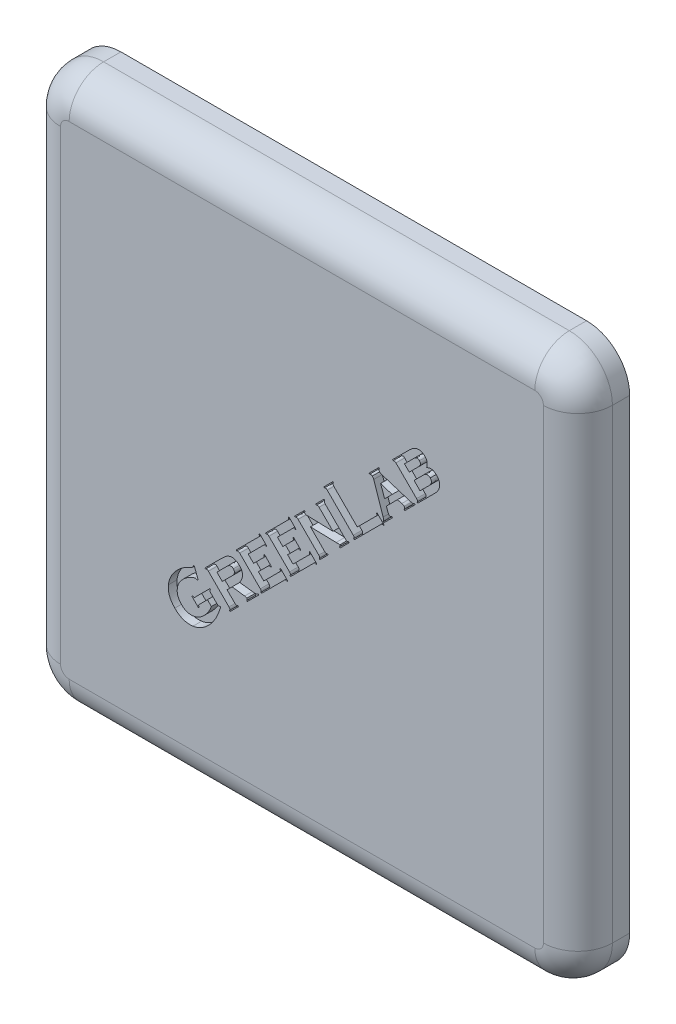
from build123d import *

# Parameters (mm, degrees)
SKETCH1_W           = 32
SKETCH1_H           = 32
BOSS_EXTRUDE1_DEPTH = 3
FILLET1_R           = 2.5
FILLET2_R           = 2
CUT_EXTRUDE1_DEPTH  = 0.5


with BuildPart() as part:
    # Sketch1 → Boss-Extrude1 (new body)
    with BuildSketch(Plane.XY.offset(3)):
        with Locations((6.5, 6.5)):
            Rectangle(SKETCH1_W, SKETCH1_H)
    extrude(amount=-BOSS_EXTRUDE1_DEPTH)

    # Fillet1
    fillet1_edges = [part.edges().sort_by_distance(p)[0] for p in [
        (-9.5, 22.5, 1.5),
        (22.5, 22.5, 1.5),
        (22.5, -9.5, 1.5),
        (-9.5, -9.5, 1.5),
    ]]
    fillet(fillet1_edges, radius=FILLET1_R)

    # Fillet2
    fillet2_edges = [part.edges().sort_by_distance(p)[0] for p in [
        (22.5, 6.5, 3),
        (-9.5, 6.5, 3),
        (6.5, -9.5, 3),
        (6.5, 22.5, 3),
        (-8.767766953, -8.767766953, 3),
        (-8.767766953, 21.767766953, 3),
        (21.767766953, -8.767766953, 3),
        (21.767766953, 21.767766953, 3),
    ]]
    fillet(fillet2_edges, radius=FILLET2_R)

    # Sketch3 → Cut-Extrude1 (cut)
    # profile 1 of 8: a face of its own
    with BuildSketch(Plane.XY.offset(3)):
        with BuildLine():
            add(Edge.make_bspline(
                [(13.726382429, 13.496158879), (13.751079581, 13.504887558), (13.797582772, 13.521323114), (13.864499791, 13.541113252), (13.924768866, 13.552289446), (13.962712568, 13.554714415), (13.980288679, 13.555837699)],
                knots=[0, 0, 0, 0, 1.199889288, 2.259316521, 3.193688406, 4, 4, 4, 4], degree=3))
            add(Edge.make_bspline(
                [(13.980288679, 13.555837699), (13.994804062, 13.554746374), (14.023732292, 13.552571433), (14.066642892, 13.542872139), (14.108899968, 13.528680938), (14.150731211, 13.510253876), (14.191882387, 13.487060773), (14.232345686, 13.459472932), (14.272385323, 13.427101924), (14.297666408, 13.402856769), (14.310692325, 13.390364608)],
                knots=[0, 0, 0, 0, 0.922926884, 1.839334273, 2.783156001, 3.749399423, 4.736154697, 5.777299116, 6.854767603, 8, 8, 8, 8], degree=3))
            add(Edge.make_bspline(
                [(14.310692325, 13.390364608), (14.327190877, 13.372986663), (14.359468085, 13.338989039), (14.400076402, 13.283234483), (14.433652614, 13.226178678), (14.459019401, 13.166976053), (14.475806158, 13.105779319), (14.484983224, 13.042947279), (14.487054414, 12.97819553), (14.481637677, 12.934960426), (14.478878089, 12.912934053)],
                knots=[0, 0, 0, 0, 1.090802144, 2.134008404, 3.134593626, 4.101849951, 5.059406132, 6.017281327, 6.989892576, 8, 8, 8, 8], degree=3))
            add(Edge.make_bspline(
                [(14.478878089, 12.912934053), (14.475102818, 12.892950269), (14.467459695, 12.852492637), (14.448611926, 12.792535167), (14.423525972, 12.73261861), (14.39161634, 12.672731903), (14.353817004, 12.612496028), (14.308644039, 12.552895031), (14.258435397, 12.49230756), (14.220909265, 12.453698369), (14.201642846, 12.433875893)],
                knots=[0, 0, 0, 0, 0.866842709, 1.754943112, 2.674639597, 3.633856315, 4.646099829, 5.704407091, 6.821411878, 8, 8, 8, 8], degree=3))
            Line((14.201642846, 12.433875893), (13.206634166, 11.438867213))
            Line((13.206634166, 11.438867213), (13.171911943, 11.473589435))
            add(Edge.make_bspline(
                [(13.171911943, 11.473589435), (13.175696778, 11.481652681), (13.182787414, 11.49675864), (13.190378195, 11.519425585), (13.193121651, 11.540798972), (13.192068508, 11.561029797), (13.187096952, 11.580947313), (13.176659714, 11.600313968), (13.163271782, 11.620863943), (13.15118493, 11.633117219), (13.144785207, 11.63960506)],
                knots=[0, 0, 0, 0, 1.162374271, 2.177631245, 3.105731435, 3.956794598, 4.809819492, 5.759872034, 6.813901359, 8, 8, 8, 8], degree=3))
            Line((13.144785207, 11.63960506), (11.949038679, 12.835351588))
            add(Edge.make_bspline(
                [(11.949038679, 12.835351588), (11.942458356, 12.841443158), (11.929984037, 12.852990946), (11.910654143, 12.86743399), (11.891312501, 12.876955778), (11.8721236, 12.882137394), (11.852210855, 12.88313564), (11.830702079, 12.880290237), (11.807395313, 12.872774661), (11.791467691, 12.866045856), (11.783023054, 12.862478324)],
                knots=[0, 0, 0, 0, 1.17324, 2.224110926, 3.144897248, 3.977198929, 4.806804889, 5.737271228, 6.800328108, 8, 8, 8, 8], degree=3))
            Line((11.783023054, 12.862478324), (11.748300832, 12.897200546))
            Line((11.748300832, 12.897200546), (12.733543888, 13.882443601))
            add(Edge.make_bspline(
                [(12.733543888, 13.882443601), (12.754671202, 13.902925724), (12.795602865, 13.942607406), (12.858471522, 13.99647432), (12.920461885, 14.04260126), (12.980656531, 14.082155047), (13.039959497, 14.11398944), (13.098367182, 14.137892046), (13.155330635, 14.155537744), (13.193512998, 14.160881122), (13.212059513, 14.163476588)],
                knots=[0, 0, 0, 0, 1.24935704, 2.420480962, 3.512492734, 4.528523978, 5.47670164, 6.365156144, 7.205898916, 8, 8, 8, 8], degree=3))
            add(Edge.make_bspline(
                [(13.212059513, 14.163476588), (13.231035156, 14.164773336), (13.268635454, 14.167342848), (13.324661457, 14.164294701), (13.378960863, 14.153452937), (13.431761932, 14.137482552), (13.48280612, 14.114165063), (13.532079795, 14.084643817), (13.580545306, 14.049364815), (13.609874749, 14.021160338), (13.624928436, 14.006684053)],
                knots=[0, 0, 0, 0, 0.997261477, 1.97607675, 2.932428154, 3.895671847, 4.863762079, 5.867635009, 6.905538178, 8, 8, 8, 8], degree=3))
            add(Edge.make_bspline(
                [(13.624928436, 14.006684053), (13.641315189, 13.989175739), (13.672732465, 13.955608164), (13.7106635, 13.90071592), (13.738591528, 13.844975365), (13.755483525, 13.786504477), (13.761544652, 13.723785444), (13.75894146, 13.654552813), (13.74718017, 13.577524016), (13.73356566, 13.52426119), (13.726382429, 13.496158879)],
                knots=[0, 0, 0, 0, 1.040550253, 1.994980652, 2.887358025, 3.737665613, 4.622542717, 5.612862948, 6.740508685, 8, 8, 8, 8], degree=3))
        make_face()
        with BuildLine():
            Line((12.720523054, 12.758311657), (13.229420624, 13.267209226))
            add(Edge.make_bspline(
                [(13.229420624, 13.267209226), (13.247618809, 13.286284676), (13.281200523, 13.321485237), (13.323488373, 13.374059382), (13.352229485, 13.422460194), (13.369960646, 13.466733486), (13.373671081, 13.509621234), (13.364245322, 13.550836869), (13.343309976, 13.59147593), (13.321771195, 13.614567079), (13.310258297, 13.626909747)],
                knots=[0, 0, 0, 0, 1.494935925, 2.758654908, 3.815734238, 4.678754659, 5.440128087, 6.216547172, 7.046709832, 8, 8, 8, 8], degree=3))
            add(Edge.make_bspline(
                [(13.310258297, 13.626909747), (13.298068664, 13.638200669), (13.275218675, 13.659365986), (13.235313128, 13.680350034), (13.194400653, 13.689843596), (13.15184134, 13.685892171), (13.107135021, 13.669174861), (13.059198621, 13.639220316), (13.005738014, 13.597588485), (12.970645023, 13.563464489), (12.951642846, 13.544987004)],
                knots=[0, 0, 0, 0, 0.940811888, 1.763592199, 2.531601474, 3.294575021, 4.155921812, 5.220444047, 6.494924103, 8, 8, 8, 8], degree=3))
            Line((12.951642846, 13.544987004), (12.442745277, 13.036089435))
            Line((12.442745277, 13.036089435), (12.720523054, 12.758311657))
        make_face(mode=Mode.SUBTRACT)
        with BuildLine():
            Line((13.345523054, 12.133311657), (13.860388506, 12.648177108))
            add(Edge.make_bspline(
                [(13.860388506, 12.648177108), (13.879516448, 12.668179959), (13.915310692, 12.705611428), (13.958347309, 12.764779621), (13.988736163, 12.821363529), (14.005436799, 12.876372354), (14.008676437, 12.929543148), (13.997801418, 12.980492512), (13.973875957, 13.029308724), (13.94888056, 13.056554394), (13.935800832, 13.070811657)],
                knots=[0, 0, 0, 0, 1.361927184, 2.548583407, 3.592382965, 4.511269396, 5.35864216, 6.186693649, 7.051123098, 8, 8, 8, 8], degree=3))
            add(Edge.make_bspline(
                [(13.935800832, 13.070811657), (13.921543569, 13.083891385), (13.894297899, 13.108886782), (13.845481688, 13.132812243), (13.794532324, 13.143687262), (13.741361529, 13.140447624), (13.686352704, 13.123746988), (13.629768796, 13.093358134), (13.570600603, 13.050321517), (13.533169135, 13.014527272), (13.513166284, 12.995399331)],
                knots=[0, 0, 0, 0, 0.948876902, 1.813306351, 2.64135784, 3.488730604, 4.407617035, 5.451416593, 6.638072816, 8, 8, 8, 8], degree=3))
            Line((13.513166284, 12.995399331), (12.998300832, 12.480533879))
            Line((12.998300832, 12.480533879), (13.345523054, 12.133311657))
        make_face(mode=Mode.SUBTRACT)
    # profile 2 of 8: a face of its own
    with BuildSketch(Plane.XY.offset(3)):
        with BuildLine():
            Line((12.039038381, 11.035160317), (11.395592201, 10.391714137))
            Line((11.395592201, 10.391714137), (11.478600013, 10.138350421))
            add(Edge.make_bspline(
                [(11.478600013, 10.138350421), (11.484010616, 10.124702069), (11.494042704, 10.099395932), (11.510845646, 10.065328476), (11.52790598, 10.037954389), (11.540651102, 10.023031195), (11.546416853, 10.016280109)],
                knots=[0, 0, 0, 0, 1.253944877, 2.325006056, 3.242251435, 4, 4, 4, 4], degree=3))
            add(Edge.make_bspline(
                [(11.546416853, 10.016280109), (11.551814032, 10.011116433), (11.562324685, 10.001060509), (11.581170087, 9.991029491), (11.600679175, 9.983881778), (11.621459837, 9.98209722), (11.643176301, 9.983599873), (11.665554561, 9.990076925), (11.689215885, 9.999796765), (11.704418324, 10.009169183), (11.712432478, 10.01410997)],
                knots=[0, 0, 0, 0, 0.98049269, 1.909445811, 2.791921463, 3.703255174, 4.636180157, 5.648641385, 6.76045214, 8, 8, 8, 8], degree=3))
            Line((11.712432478, 10.01410997), (11.747154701, 9.979387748))
            Line((11.747154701, 9.979387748), (11.226321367, 9.458554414))
            Line((11.226321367, 9.458554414), (11.191599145, 9.493276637))
            add(Edge.make_bspline(
                [(11.191599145, 9.493276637), (11.197969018, 9.502546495), (11.209978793, 9.520023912), (11.223643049, 9.546792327), (11.233035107, 9.572032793), (11.236366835, 9.597731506), (11.234754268, 9.625851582), (11.229177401, 9.658961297), (11.218192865, 9.698214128), (11.209402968, 9.726413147), (11.204619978, 9.741757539)],
                knots=[0, 0, 0, 0, 1.025957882, 1.934343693, 2.73859768, 3.471910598, 4.281739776, 5.302501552, 6.532166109, 8, 8, 8, 8], degree=3))
            Line((11.204619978, 9.741757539), (10.657744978, 11.356340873))
            add(Edge.make_bspline(
                [(10.657744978, 11.356340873), (10.652345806, 11.370710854), (10.642137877, 11.397879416), (10.624339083, 11.435510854), (10.603968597, 11.467044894), (10.588152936, 11.484730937), (10.580705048, 11.493059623)],
                knots=[0, 0, 0, 0, 1.164499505, 2.201657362, 3.153127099, 4, 4, 4, 4], degree=3))
            add(Edge.make_bspline(
                [(10.580705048, 11.493059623), (10.571194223, 11.500720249), (10.551987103, 11.516190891), (10.513216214, 11.525391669), (10.469605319, 11.520200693), (10.440356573, 11.509647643), (10.424455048, 11.503910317)],
                knots=[0, 0, 0, 0, 0.872099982, 1.761206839, 2.78284612, 4, 4, 4, 4], degree=3))
            Line((10.424455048, 11.503910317), (10.389732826, 11.538632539))
            Line((10.389732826, 11.538632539), (10.953426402, 12.102326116))
            Line((10.953426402, 12.102326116), (10.988148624, 12.067603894))
            add(Edge.make_bspline(
                [(10.988148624, 12.067603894), (10.982208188, 12.051913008), (10.971243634, 12.022951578), (10.968395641, 11.978537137), (10.979326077, 11.938366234), (10.996343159, 11.917918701), (11.004967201, 11.90755615)],
                knots=[0, 0, 0, 0, 1.168555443, 2.156859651, 3.065919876, 4, 4, 4, 4], degree=3))
            add(Edge.make_bspline(
                [(11.004967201, 11.90755615), (11.013107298, 11.90044725), (11.030560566, 11.885204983), (11.062321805, 11.866108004), (11.100360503, 11.848543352), (11.128370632, 11.83926422), (11.143313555, 11.834313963)],
                knots=[0, 0, 0, 0, 0.820243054, 1.758691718, 2.804300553, 4, 4, 4, 4], degree=3))
            Line((11.143313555, 11.834313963), (12.736738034, 11.330299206))
            add(Edge.make_bspline(
                [(12.736738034, 11.330299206), (12.756765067, 11.324343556), (12.793400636, 11.313448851), (12.843729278, 11.300967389), (12.884006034, 11.292701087), (12.916519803, 11.289748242), (12.945192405, 11.292790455), (12.973275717, 11.301037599), (13.002477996, 11.315290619), (13.021679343, 11.327219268), (13.031876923, 11.333554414)],
                knots=[0, 0, 0, 0, 1.620976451, 2.965261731, 4.022044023, 4.809834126, 5.487011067, 6.246422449, 7.068698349, 8, 8, 8, 8], degree=3))
            Line((13.031876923, 11.333554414), (13.066599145, 11.298832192))
            Line((13.066599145, 11.298832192), (12.458960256, 10.691193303))
            Line((12.458960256, 10.691193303), (12.424238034, 10.725915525))
            add(Edge.make_bspline(
                [(12.424238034, 10.725915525), (12.429574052, 10.733902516), (12.439643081, 10.748973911), (12.449860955, 10.772785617), (12.456835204, 10.795118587), (12.45913898, 10.816870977), (12.457049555, 10.83781895), (12.450178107, 10.857585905), (12.439856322, 10.876785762), (12.429594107, 10.887450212), (12.424238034, 10.89301622)],
                knots=[0, 0, 0, 0, 1.248668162, 2.356228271, 3.36270237, 4.286353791, 5.186571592, 6.080602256, 6.998224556, 8, 8, 8, 8], degree=3))
            add(Edge.make_bspline(
                [(12.424238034, 10.89301622), (12.416110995, 10.900147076), (12.39887318, 10.915271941), (12.366922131, 10.934018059), (12.32912415, 10.952055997), (12.300852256, 10.96134367), (12.28589168, 10.966258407)],
                knots=[0, 0, 0, 0, 0.820374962, 1.740052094, 2.804108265, 4, 4, 4, 4], degree=3))
            Line((12.28589168, 10.966258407), (12.039038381, 11.035160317))
        make_face()
        Polygon((11.724368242, 11.137156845), (11.060305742, 11.359596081), (11.28871286, 10.701501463), align=None, mode=Mode.SUBTRACT)
    # profile 3 of 8: a face of its own
    with BuildSketch(Plane.XY.offset(3)):
        with BuildLine():
            Line((9.707567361, 8.495355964), (10.793721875, 9.581510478))
            add(Edge.make_bspline(
                [(10.793721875, 9.581510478), (10.799826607, 9.588079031), (10.811227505, 9.600346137), (10.8253859, 9.619591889), (10.834605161, 9.638546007), (10.840230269, 9.657488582), (10.840139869, 9.677263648), (10.837839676, 9.698691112), (10.829380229, 9.721528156), (10.822390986, 9.737089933), (10.818678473, 9.745355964)],
                knots=[0, 0, 0, 0, 1.185832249, 2.21460199, 3.145271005, 3.963406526, 4.80089252, 5.741345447, 6.800258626, 8, 8, 8, 8], degree=3))
            Line((10.818678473, 9.745355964), (10.853400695, 9.780078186))
            Line((10.853400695, 9.780078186), (11.270067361, 9.36341152))
            Line((11.270067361, 9.36341152), (11.235345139, 9.328689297))
            add(Edge.make_bspline(
                [(11.235345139, 9.328689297), (11.227078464, 9.332403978), (11.211515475, 9.339397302), (11.18868641, 9.347829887), (11.167233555, 9.35021556), (11.147585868, 9.350029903), (11.128540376, 9.345498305), (11.110231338, 9.335618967), (11.090729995, 9.322591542), (11.078909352, 9.311012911), (11.072584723, 9.30481777)],
                knots=[0, 0, 0, 0, 1.208636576, 2.275400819, 3.222826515, 4.066521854, 4.884713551, 5.800668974, 6.823248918, 8, 8, 8, 8], degree=3))
            Line((11.072584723, 9.30481777), (9.53395625, 7.766189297))
            Line((9.53395625, 7.766189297), (9.499234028, 7.80091152))
            add(Edge.make_bspline(
                [(9.499234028, 7.80091152), (9.503068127, 7.809146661), (9.510335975, 7.824757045), (9.517255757, 7.847951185), (9.52117882, 7.869136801), (9.519924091, 7.888935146), (9.514812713, 7.908113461), (9.505269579, 7.92745832), (9.490833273, 7.946787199), (9.479284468, 7.959261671), (9.473192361, 7.965842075)],
                knots=[0, 0, 0, 0, 1.191880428, 2.259306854, 3.173437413, 4.006453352, 4.842176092, 5.766747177, 6.821937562, 8, 8, 8, 8], degree=3))
            Line((9.473192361, 7.965842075), (7.962775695, 9.476258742))
            add(Edge.make_bspline(
                [(7.962775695, 9.476258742), (7.95619529, 9.482350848), (7.943720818, 9.493899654), (7.92439194, 9.508335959), (7.905047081, 9.517879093), (7.885868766, 9.522990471), (7.866070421, 9.524245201), (7.844884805, 9.520322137), (7.821690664, 9.513402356), (7.80608028, 9.506134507), (7.797845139, 9.502300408)],
                knots=[0, 0, 0, 0, 1.178062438, 2.233252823, 3.157823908, 3.993546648, 4.826562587, 5.740693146, 6.808119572, 8, 8, 8, 8], degree=3))
            Line((7.797845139, 9.502300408), (7.763122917, 9.537022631))
            Line((7.763122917, 9.537022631), (8.28395625, 10.057855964))
            Line((8.28395625, 10.057855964), (8.318678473, 10.023133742))
            add(Edge.make_bspline(
                [(8.318678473, 10.023133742), (8.314628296, 10.015100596), (8.30699226, 9.999955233), (8.299964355, 9.97683704), (8.296263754, 9.95545853), (8.297233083, 9.935200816), (8.303271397, 9.915749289), (8.313157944, 9.896460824), (8.326997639, 9.876365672), (8.3389035, 9.864173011), (8.345262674, 9.857660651)],
                knots=[0, 0, 0, 0, 1.172211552, 2.210039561, 3.141477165, 3.992578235, 4.829152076, 5.779246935, 6.813848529, 8, 8, 8, 8], degree=3))
            Line((8.345262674, 9.857660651), (9.707567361, 8.495355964))
        make_face()
    # profile 4 of 8: a face of its own
    with BuildSketch(Plane.XY.offset(3)):
        with BuildLine():
            Line((6.990343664, 7.145319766), (7.819336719, 6.316326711))
            add(Edge.make_bspline(
                [(7.819336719, 6.316326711), (7.83191851, 6.305036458), (7.854799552, 6.284504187), (7.890175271, 6.269172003), (7.917992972, 6.26797742), (7.93973794, 6.270992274), (7.962974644, 6.277450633), (7.978385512, 6.284455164), (7.986437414, 6.288114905)],
                knots=[0, 0, 0, 0, 1.648152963, 2.997304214, 3.652314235, 4.347366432, 5.136528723, 6, 6, 6, 6], degree=3))
            Line((7.986437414, 6.288114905), (8.021159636, 6.253392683))
            Line((8.021159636, 6.253392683), (7.535048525, 5.767281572))
            Line((7.535048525, 5.767281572), (7.500326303, 5.802003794))
            add(Edge.make_bspline(
                [(7.500326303, 5.802003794), (7.504111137, 5.810067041), (7.511201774, 5.825172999), (7.518792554, 5.847839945), (7.52153601, 5.869213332), (7.520482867, 5.889444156), (7.515511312, 5.909361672), (7.505074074, 5.928728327), (7.491686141, 5.949278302), (7.47959929, 5.961531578), (7.473199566, 5.968019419)],
                knots=[0, 0, 0, 0, 1.162374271, 2.177631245, 3.105731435, 3.956794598, 4.809819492, 5.759872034, 6.813901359, 8, 8, 8, 8], degree=3))
            Line((7.473199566, 5.968019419), (6.277453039, 7.163765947))
            add(Edge.make_bspline(
                [(6.277453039, 7.163765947), (6.270872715, 7.169857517), (6.258398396, 7.181405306), (6.239068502, 7.19584835), (6.21972686, 7.205370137), (6.200537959, 7.210551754), (6.180625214, 7.211549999), (6.159116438, 7.208704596), (6.135809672, 7.20118902), (6.11988205, 7.194460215), (6.111437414, 7.190892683)],
                knots=[0, 0, 0, 0, 1.17324, 2.224110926, 3.144897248, 3.977198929, 4.806804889, 5.737271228, 6.800328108, 8, 8, 8, 8], degree=3))
            Line((6.111437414, 7.190892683), (6.076715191, 7.225614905))
            Line((6.076715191, 7.225614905), (6.643121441, 7.792021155))
            Line((6.643121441, 7.792021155), (6.677843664, 7.757298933))
            add(Edge.make_bspline(
                [(6.677843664, 7.757298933), (6.671870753, 7.746311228), (6.66110079, 7.726498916), (6.653643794, 7.696276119), (6.656024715, 7.668687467), (6.666284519, 7.655353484), (6.671333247, 7.648791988)],
                knots=[0, 0, 0, 0, 1.278287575, 2.304924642, 3.165873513, 4, 4, 4, 4], degree=3))
            add(Edge.make_bspline(
                [(6.671333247, 7.648791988), (6.677453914, 7.643909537), (6.690736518, 7.633314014), (6.717579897, 7.624235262), (6.750080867, 7.618316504), (6.774014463, 7.618024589), (6.786893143, 7.617867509)],
                knots=[0, 0, 0, 0, 0.763280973, 1.656414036, 2.738915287, 4, 4, 4, 4], degree=3))
            Line((6.786893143, 7.617867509), (8.298394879, 7.573379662))
            Line((8.298394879, 7.573379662), (7.492730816, 8.379043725))
            add(Edge.make_bspline(
                [(7.492730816, 8.379043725), (7.486220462, 8.385409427), (7.474031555, 8.39732751), (7.453911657, 8.411086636), (7.43474719, 8.421213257), (7.41526152, 8.426348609), (7.395361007, 8.427384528), (7.373865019, 8.424488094), (7.35057186, 8.417196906), (7.334954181, 8.409978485), (7.326715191, 8.406170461)],
                knots=[0, 0, 0, 0, 1.185976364, 2.220425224, 3.170379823, 4.0004794, 4.827890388, 5.755894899, 6.816139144, 8, 8, 8, 8], degree=3))
            Line((7.326715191, 8.406170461), (7.291992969, 8.440892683))
            Line((7.291992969, 8.440892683), (7.77810408, 8.927003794))
            Line((7.77810408, 8.927003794), (7.812826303, 8.892281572))
            add(Edge.make_bspline(
                [(7.812826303, 8.892281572), (7.808997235, 8.884046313), (7.801738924, 8.868435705), (7.7947047, 8.845071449), (7.790943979, 8.82351841), (7.79194441, 8.803273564), (7.797836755, 8.783928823), (7.808023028, 8.764974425), (7.821662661, 8.744958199), (7.833585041, 8.732773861), (7.839953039, 8.726265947)],
                knots=[0, 0, 0, 0, 1.182064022, 2.240699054, 3.170585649, 4.020269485, 4.855450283, 5.782944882, 6.815823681, 8, 8, 8, 8], degree=3))
            Line((7.839953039, 8.726265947), (9.034614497, 7.531604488))
            add(Edge.make_bspline(
                [(9.034614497, 7.531604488), (9.041151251, 7.525449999), (9.053466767, 7.513854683), (9.073310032, 7.500198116), (9.092278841, 7.490047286), (9.111626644, 7.484093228), (9.132001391, 7.483308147), (9.153767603, 7.48617909), (9.177448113, 7.492927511), (9.193290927, 7.499759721), (9.201715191, 7.503392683)],
                knots=[0, 0, 0, 0, 1.166855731, 2.198404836, 3.12470541, 3.958811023, 4.807401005, 5.756153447, 6.806856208, 8, 8, 8, 8], degree=3))
            Line((9.201715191, 7.503392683), (9.236437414, 7.468670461))
            Line((9.236437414, 7.468670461), (8.708551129, 6.940784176))
            Line((8.708551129, 6.940784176), (8.673828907, 6.975506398))
            add(Edge.make_bspline(
                [(8.673828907, 6.975506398), (8.680274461, 6.986117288), (8.691904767, 7.005263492), (8.701421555, 7.034626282), (8.699512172, 7.062050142), (8.689216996, 7.074940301), (8.684137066, 7.081300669)],
                knots=[0, 0, 0, 0, 1.286319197, 2.3210239, 3.171545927, 4, 4, 4, 4], degree=3))
            add(Edge.make_bspline(
                [(8.684137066, 7.081300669), (8.676829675, 7.086806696), (8.660965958, 7.098759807), (8.63346765, 7.10309307), (8.60481047, 7.104957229), (8.572546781, 7.105902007), (8.530424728, 7.106276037), (8.499134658, 7.106612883), (8.481771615, 7.106799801)],
                knots=[0, 0, 0, 0, 0.783116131, 1.700077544, 2.34485283, 3.286433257, 4.494225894, 6, 6, 6, 6], degree=3))
            Line((8.481771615, 7.106799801), (6.990343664, 7.145319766))
        make_face()
    # profile 5 of 8: a face of its own
    with BuildSketch(Plane.XY.offset(3)):
        with BuildLine():
            Line((5.667327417, 5.08011602), (5.979827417, 4.76761602))
            Line((5.979827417, 4.76761602), (6.891828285, 5.679616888))
            add(Edge.make_bspline(
                [(6.891828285, 5.679616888), (6.897957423, 5.685984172), (6.909484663, 5.697959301), (6.923459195, 5.717169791), (6.932773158, 5.736105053), (6.938146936, 5.755066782), (6.939027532, 5.774999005), (6.936334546, 5.796521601), (6.928740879, 5.819997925), (6.921326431, 5.835593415), (6.917327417, 5.844004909)],
                knots=[0, 0, 0, 0, 1.163548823, 2.188318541, 3.115368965, 3.930323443, 4.765573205, 5.726006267, 6.773511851, 8, 8, 8, 8], degree=3))
            Line((6.917327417, 5.844004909), (6.952049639, 5.878727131))
            Line((6.952049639, 5.878727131), (7.368716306, 5.462060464))
            Line((7.368716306, 5.462060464), (7.333994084, 5.427338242))
            add(Edge.make_bspline(
                [(7.333994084, 5.427338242), (7.326142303, 5.431384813), (7.311363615, 5.439001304), (7.288628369, 5.446111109), (7.267384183, 5.449789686), (7.240068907, 5.448218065), (7.204778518, 5.434538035), (7.182482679, 5.413834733), (7.170148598, 5.402381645)],
                knots=[0, 0, 0, 0, 0.874759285, 1.646479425, 2.354455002, 3.001367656, 4.341153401, 6, 6, 6, 6], degree=3))
            Line((7.170148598, 5.402381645), (5.840938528, 4.073171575))
            Line((5.840938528, 4.073171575), (5.806216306, 4.107893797))
            add(Edge.make_bspline(
                [(5.806216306, 4.107893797), (5.81000114, 4.115957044), (5.817091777, 4.131063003), (5.824682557, 4.153729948), (5.827426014, 4.175103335), (5.82637287, 4.19533416), (5.821401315, 4.215251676), (5.810964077, 4.23461833), (5.797576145, 4.255168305), (5.785489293, 4.267421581), (5.77908957, 4.273909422)],
                knots=[0, 0, 0, 0, 1.162374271, 2.177631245, 3.105731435, 3.956794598, 4.809819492, 5.759872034, 6.813901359, 8, 8, 8, 8], degree=3))
            Line((5.77908957, 4.273909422), (4.583343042, 5.46965595))
            add(Edge.make_bspline(
                [(4.583343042, 5.46965595), (4.576762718, 5.47574752), (4.5642884, 5.487295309), (4.544958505, 5.501738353), (4.525616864, 5.511260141), (4.506427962, 5.516441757), (4.486515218, 5.517440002), (4.465006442, 5.514594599), (4.441699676, 5.507079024), (4.425772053, 5.500350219), (4.417327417, 5.496782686)],
                knots=[0, 0, 0, 0, 1.17324, 2.224110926, 3.144897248, 3.977198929, 4.806804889, 5.737271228, 6.800328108, 8, 8, 8, 8], degree=3))
            Line((4.417327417, 5.496782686), (4.382605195, 5.531504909))
            Line((4.382605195, 5.531504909), (5.675465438, 6.824365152))
            add(Edge.make_bspline(
                [(5.675465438, 6.824365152), (5.681811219, 6.830889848), (5.693867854, 6.843286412), (5.707741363, 6.863140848), (5.717767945, 6.88219677), (5.722723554, 6.901287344), (5.723975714, 6.921240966), (5.720147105, 6.942632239), (5.713144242, 6.965991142), (5.705881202, 6.981602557), (5.702049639, 6.989838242)],
                knots=[0, 0, 0, 0, 1.188444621, 2.257979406, 3.157025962, 3.988853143, 4.817986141, 5.751224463, 6.81367529, 8, 8, 8, 8], degree=3))
            Line((5.702049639, 6.989838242), (5.736771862, 7.024560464))
            Line((5.736771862, 7.024560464), (6.153438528, 6.607893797))
            Line((6.153438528, 6.607893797), (6.118716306, 6.573171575))
            add(Edge.make_bspline(
                [(6.118716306, 6.573171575), (6.110305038, 6.577169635), (6.094709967, 6.584582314), (6.071230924, 6.592187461), (6.049717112, 6.59484337), (6.029531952, 6.59407236), (6.010629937, 6.588153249), (5.991458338, 6.578392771), (5.971627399, 6.564425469), (5.959227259, 6.552383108), (5.952700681, 6.546044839)],
                knots=[0, 0, 0, 0, 1.212189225, 2.247482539, 3.196718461, 4.022230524, 4.856761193, 5.751881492, 6.816745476, 8, 8, 8, 8], degree=3))
            Line((5.952700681, 6.546044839), (5.077049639, 5.670393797))
            Line((5.077049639, 5.670393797), (5.389549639, 5.357893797))
            Line((5.389549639, 5.357893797), (5.949445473, 5.917789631))
            add(Edge.make_bspline(
                [(5.949445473, 5.917789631), (5.955731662, 5.924539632), (5.967492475, 5.937168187), (5.98216283, 5.956948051), (5.991980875, 5.97643418), (5.997930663, 5.995903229), (5.999396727, 6.016376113), (5.997263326, 6.038449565), (5.990147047, 6.062384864), (5.98342966, 6.078447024), (5.979827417, 6.087060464)],
                knots=[0, 0, 0, 0, 1.18350369, 2.214213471, 3.148414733, 3.970994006, 4.809465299, 5.76561053, 6.801793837, 8, 8, 8, 8], degree=3))
            Line((5.979827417, 6.087060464), (6.014549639, 6.121782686))
            Line((6.014549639, 6.121782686), (6.431216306, 5.70511602))
            Line((6.431216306, 5.70511602), (6.396494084, 5.670393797))
            add(Edge.make_bspline(
                [(6.396494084, 5.670393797), (6.388270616, 5.674250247), (6.372885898, 5.681465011), (6.349460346, 5.68818325), (6.327858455, 5.69103984), (6.307338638, 5.690153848), (6.287484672, 5.684382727), (6.267862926, 5.673428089), (6.247163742, 5.658830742), (6.234124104, 5.646524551), (6.22722325, 5.640011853)],
                knots=[0, 0, 0, 0, 1.158651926, 2.167641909, 3.098801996, 3.931656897, 4.772481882, 5.712765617, 6.789546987, 8, 8, 8, 8], degree=3))
            Line((6.22722325, 5.640011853), (5.667327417, 5.08011602))
        make_face()
    # profile 6 of 8: a face of its own
    with BuildSketch(Plane.XY.offset(3)):
        with BuildLine():
            Line((3.97321742, 3.386006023), (4.28571742, 3.073506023))
            Line((4.28571742, 3.073506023), (5.197718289, 3.985506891))
            add(Edge.make_bspline(
                [(5.197718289, 3.985506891), (5.203847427, 3.991874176), (5.215374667, 4.003849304), (5.229349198, 4.023059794), (5.238663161, 4.041995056), (5.244036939, 4.060956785), (5.244917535, 4.080889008), (5.24222455, 4.102411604), (5.234630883, 4.125887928), (5.227216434, 4.141483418), (5.22321742, 4.149894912)],
                knots=[0, 0, 0, 0, 1.163548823, 2.188318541, 3.115368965, 3.930323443, 4.765573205, 5.726006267, 6.773511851, 8, 8, 8, 8], degree=3))
            Line((5.22321742, 4.149894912), (5.257939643, 4.184617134))
            Line((5.257939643, 4.184617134), (5.674606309, 3.767950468))
            Line((5.674606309, 3.767950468), (5.639884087, 3.733228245))
            add(Edge.make_bspline(
                [(5.639884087, 3.733228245), (5.632032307, 3.737274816), (5.617253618, 3.744891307), (5.594518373, 3.752001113), (5.573274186, 3.75567969), (5.545958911, 3.754108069), (5.510668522, 3.740428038), (5.488372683, 3.719724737), (5.476038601, 3.708271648)],
                knots=[0, 0, 0, 0, 0.874759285, 1.646479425, 2.354455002, 3.001367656, 4.341153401, 6, 6, 6, 6], degree=3))
            Line((5.476038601, 3.708271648), (4.146828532, 2.379061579))
            Line((4.146828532, 2.379061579), (4.112106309, 2.413783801))
            add(Edge.make_bspline(
                [(4.112106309, 2.413783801), (4.115891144, 2.421847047), (4.12298178, 2.436953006), (4.130572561, 2.459619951), (4.133316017, 2.480993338), (4.132262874, 2.501224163), (4.127291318, 2.521141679), (4.116854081, 2.540508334), (4.103466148, 2.561058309), (4.091379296, 2.573311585), (4.084979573, 2.579799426)],
                knots=[0, 0, 0, 0, 1.162374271, 2.177631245, 3.105731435, 3.956794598, 4.809819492, 5.759872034, 6.813901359, 8, 8, 8, 8], degree=3))
            Line((4.084979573, 2.579799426), (2.889233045, 3.775545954))
            add(Edge.make_bspline(
                [(2.889233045, 3.775545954), (2.882652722, 3.781637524), (2.870178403, 3.793185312), (2.850848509, 3.807628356), (2.831506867, 3.817150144), (2.812317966, 3.82233176), (2.792405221, 3.823330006), (2.770896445, 3.820484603), (2.747589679, 3.812969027), (2.731662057, 3.806240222), (2.72321742, 3.80267269)],
                knots=[0, 0, 0, 0, 1.17324, 2.224110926, 3.144897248, 3.977198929, 4.806804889, 5.737271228, 6.800328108, 8, 8, 8, 8], degree=3))
            Line((2.72321742, 3.80267269), (2.688495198, 3.837394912))
            Line((2.688495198, 3.837394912), (3.981355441, 5.130255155))
            add(Edge.make_bspline(
                [(3.981355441, 5.130255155), (3.987701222, 5.136779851), (3.999757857, 5.149176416), (4.013631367, 5.169030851), (4.023657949, 5.188086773), (4.028613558, 5.207177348), (4.029865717, 5.227130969), (4.026037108, 5.248522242), (4.019034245, 5.271881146), (4.011771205, 5.28749256), (4.007939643, 5.295728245)],
                knots=[0, 0, 0, 0, 1.188444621, 2.257979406, 3.157025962, 3.988853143, 4.817986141, 5.751224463, 6.81367529, 8, 8, 8, 8], degree=3))
            Line((4.007939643, 5.295728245), (4.042661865, 5.330450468))
            Line((4.042661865, 5.330450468), (4.459328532, 4.913783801))
            Line((4.459328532, 4.913783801), (4.424606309, 4.879061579))
            add(Edge.make_bspline(
                [(4.424606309, 4.879061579), (4.416195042, 4.883059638), (4.400599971, 4.890472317), (4.377120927, 4.898077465), (4.355607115, 4.900733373), (4.335421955, 4.899962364), (4.31651994, 4.894043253), (4.297348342, 4.884282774), (4.277517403, 4.870315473), (4.265117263, 4.858273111), (4.258590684, 4.851934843)],
                knots=[0, 0, 0, 0, 1.212189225, 2.247482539, 3.196718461, 4.022230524, 4.856761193, 5.751881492, 6.816745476, 8, 8, 8, 8], degree=3))
            Line((4.258590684, 4.851934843), (3.382939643, 3.976283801))
            Line((3.382939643, 3.976283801), (3.695439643, 3.663783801))
            Line((3.695439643, 3.663783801), (4.255335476, 4.223679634))
            add(Edge.make_bspline(
                [(4.255335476, 4.223679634), (4.261621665, 4.230429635), (4.273382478, 4.243058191), (4.288052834, 4.262838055), (4.297870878, 4.282324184), (4.303820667, 4.301793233), (4.305286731, 4.322266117), (4.30315333, 4.344339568), (4.296037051, 4.368274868), (4.289319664, 4.384337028), (4.28571742, 4.392950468)],
                knots=[0, 0, 0, 0, 1.18350369, 2.214213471, 3.148414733, 3.970994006, 4.809465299, 5.76561053, 6.801793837, 8, 8, 8, 8], degree=3))
            Line((4.28571742, 4.392950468), (4.320439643, 4.42767269))
            Line((4.320439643, 4.42767269), (4.737106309, 4.011006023))
            Line((4.737106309, 4.011006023), (4.702384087, 3.976283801))
            add(Edge.make_bspline(
                [(4.702384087, 3.976283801), (4.694160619, 3.98014025), (4.678775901, 3.987355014), (4.655350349, 3.994073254), (4.633748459, 3.996929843), (4.613228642, 3.996043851), (4.593374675, 3.99027273), (4.57375293, 3.979318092), (4.553053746, 3.964720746), (4.540014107, 3.952414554), (4.533113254, 3.945901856)],
                knots=[0, 0, 0, 0, 1.158651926, 2.167641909, 3.098801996, 3.931656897, 4.772481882, 5.712765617, 6.789546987, 8, 8, 8, 8], degree=3))
            Line((4.533113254, 3.945901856), (3.97321742, 3.386006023))
        make_face()
    # profile 7 of 8: a face of its own
    with BuildSketch(Plane.XY.offset(3)):
        with BuildLine():
            Line((2.15634583, 1.569134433), (2.61587274, 1.109607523))
            add(Edge.make_bspline(
                [(2.61587274, 1.109607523), (2.622167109, 1.103364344), (2.63403797, 1.091590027), (2.65413542, 1.079062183), (2.672444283, 1.068258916), (2.691741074, 1.063425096), (2.711780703, 1.062366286), (2.733500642, 1.065145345), (2.75697201, 1.072730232), (2.772900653, 1.079456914), (2.78134583, 1.083023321)],
                knots=[0, 0, 0, 0, 1.160250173, 2.188172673, 3.102156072, 3.937744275, 4.770626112, 5.728336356, 6.795590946, 8, 8, 8, 8], degree=3))
            Line((2.78134583, 1.083023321), (2.816068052, 1.048301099))
            Line((2.816068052, 1.048301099), (2.329956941, 0.562189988))
            Line((2.329956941, 0.562189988), (2.295234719, 0.59691221))
            add(Edge.make_bspline(
                [(2.295234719, 0.59691221), (2.299019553, 0.604975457), (2.30611019, 0.620081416), (2.31370097, 0.642748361), (2.316444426, 0.664121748), (2.315391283, 0.684352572), (2.310419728, 0.704270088), (2.29998249, 0.723636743), (2.286594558, 0.744186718), (2.274507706, 0.756439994), (2.268107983, 0.762927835)],
                knots=[0, 0, 0, 0, 1.162374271, 2.177631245, 3.105731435, 3.956794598, 4.809819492, 5.759872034, 6.813901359, 8, 8, 8, 8], degree=3))
            Line((2.268107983, 0.762927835), (1.072361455, 1.958674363))
            add(Edge.make_bspline(
                [(1.072361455, 1.958674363), (1.065781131, 1.964765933), (1.053306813, 1.976313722), (1.033976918, 1.990756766), (1.014635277, 2.000278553), (0.995446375, 2.00546017), (0.97553363, 2.006458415), (0.954024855, 2.003613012), (0.930718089, 1.996097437), (0.914790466, 1.989368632), (0.90634583, 1.985801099)],
                knots=[0, 0, 0, 0, 1.17324, 2.224110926, 3.144897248, 3.977198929, 4.806804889, 5.737271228, 6.800328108, 8, 8, 8, 8], degree=3))
            Line((0.90634583, 1.985801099), (0.871623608, 2.020523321))
            Line((0.871623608, 2.020523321), (1.821601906, 2.97050162))
            add(Edge.make_bspline(
                [(1.821601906, 2.97050162), (1.836816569, 2.985306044), (1.866329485, 3.014023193), (1.908845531, 3.056179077), (1.950054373, 3.093821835), (1.988952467, 3.128349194), (2.025408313, 3.159789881), (2.060282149, 3.187247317), (2.092338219, 3.212114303), (2.132458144, 3.239920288), (2.181625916, 3.270190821), (2.242424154, 3.298721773), (2.303673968, 3.322390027), (2.345905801, 3.331964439), (2.366849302, 3.336712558)],
                knots=[0, 0, 0, 0, 1.146006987, 2.222987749, 3.231699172, 4.158369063, 5.030901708, 5.829820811, 6.554224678, 7.220441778, 8.464427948, 9.665259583, 10.842161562, 12, 12, 12, 12], degree=3))
            add(Edge.make_bspline(
                [(2.366849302, 3.336712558), (2.388493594, 3.34001147), (2.431436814, 3.346556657), (2.496781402, 3.345990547), (2.561293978, 3.335197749), (2.62526518, 3.316250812), (2.687944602, 3.287486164), (2.749964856, 3.249983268), (2.811193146, 3.203326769), (2.8495072, 3.166746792), (2.869236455, 3.147910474)],
                knots=[0, 0, 0, 0, 0.937085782, 1.859219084, 2.78534819, 3.731647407, 4.709617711, 5.731541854, 6.831891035, 8, 8, 8, 8], degree=3))
            add(Edge.make_bspline(
                [(2.869236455, 3.147910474), (2.883718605, 3.132719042), (2.911863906, 3.103195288), (2.949817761, 3.056991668), (2.981086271, 3.009633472), (3.007686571, 2.962126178), (3.028325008, 2.913717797), (3.043536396, 2.864812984), (3.053715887, 2.815401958), (3.057295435, 2.765109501), (3.055588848, 2.713485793), (3.048419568, 2.660256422), (3.035661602, 2.605133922), (3.017696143, 2.547930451), (2.993621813, 2.488940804), (2.964019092, 2.428022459), (2.929444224, 2.365054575), (2.902936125, 2.323472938), (2.88931024, 2.302098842)],
                knots=[0, 0, 0, 0, 1.075980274, 2.091111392, 3.060626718, 3.981944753, 4.87924729, 5.753202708, 6.604231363, 7.459743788, 8.331778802, 9.248419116, 10.208891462, 11.229428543, 12.31934167, 13.472236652, 14.7006607, 16, 16, 16, 16], degree=3))
            Line((2.88931024, 2.302098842), (3.540351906, 2.223973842))
            add(Edge.make_bspline(
                [(3.540351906, 2.223973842), (3.568891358, 2.219884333), (3.621520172, 2.212342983), (3.694702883, 2.206037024), (3.755340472, 2.202567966), (3.8057723, 2.204269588), (3.849081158, 2.211766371), (3.888992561, 2.223520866), (3.926719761, 2.241207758), (3.950117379, 2.256085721), (3.961901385, 2.263578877)],
                knots=[0, 0, 0, 0, 1.590498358, 2.932994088, 4.051720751, 4.940720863, 5.710116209, 6.47092196, 7.229893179, 8, 8, 8, 8], degree=3))
            Line((3.961901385, 2.263578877), (3.996623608, 2.228856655))
            Line((3.996623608, 2.228856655), (3.32822083, 1.560453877))
            Line((3.32822083, 1.560453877), (3.293498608, 1.595176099))
            add(Edge.make_bspline(
                [(3.293498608, 1.595176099), (3.300980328, 1.608677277), (3.314377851, 1.632853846), (3.324591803, 1.668804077), (3.324328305, 1.7012967), (3.312638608, 1.716502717), (3.307061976, 1.723756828)],
                knots=[0, 0, 0, 0, 1.329216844, 2.380229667, 3.227280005, 4, 4, 4, 4], degree=3))
            add(Edge.make_bspline(
                [(3.307061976, 1.723756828), (3.300934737, 1.72863737), (3.286870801, 1.739839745), (3.257013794, 1.749390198), (3.21941598, 1.758691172), (3.190850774, 1.762411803), (3.175226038, 1.764446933)],
                knots=[0, 0, 0, 0, 0.667527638, 1.532185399, 2.650142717, 4, 4, 4, 4], degree=3))
            Line((3.175226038, 1.764446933), (2.44822951, 1.861018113))
            Line((2.44822951, 1.861018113), (2.15634583, 1.569134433))
        make_face()
        with BuildLine():
            Line((1.878568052, 1.84691221), (2.414592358, 2.382936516))
            add(Edge.make_bspline(
                [(2.414592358, 2.382936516), (2.433339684, 2.402203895), (2.468309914, 2.438144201), (2.512594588, 2.491985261), (2.5479759, 2.539882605), (2.563312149, 2.572575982), (2.570299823, 2.587472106)],
                knots=[0, 0, 0, 0, 1.247415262, 2.326859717, 3.23766498, 4, 4, 4, 4], degree=3))
            add(Edge.make_bspline(
                [(2.570299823, 2.587472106), (2.573822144, 2.596973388), (2.580676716, 2.615463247), (2.586285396, 2.644004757), (2.586761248, 2.672064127), (2.582885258, 2.699506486), (2.574839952, 2.726425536), (2.561176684, 2.752374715), (2.543277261, 2.777891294), (2.528551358, 2.793627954), (2.520929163, 2.801773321)],
                knots=[0, 0, 0, 0, 1.032980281, 2.010219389, 2.9516005, 3.883344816, 4.829057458, 5.802980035, 6.862812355, 8, 8, 8, 8], degree=3))
            add(Edge.make_bspline(
                [(2.520929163, 2.801773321), (2.506832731, 2.814805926), (2.480456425, 2.839191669), (2.434347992, 2.863072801), (2.387264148, 2.873280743), (2.347819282, 2.868400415), (2.316258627, 2.85845483), (2.290905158, 2.845848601), (2.263033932, 2.831124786), (2.234374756, 2.810887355), (2.203446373, 2.787761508), (2.170967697, 2.760467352), (2.136747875, 2.729540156), (2.113943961, 2.707099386), (2.102092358, 2.695436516)],
                knots=[0, 0, 0, 0, 1.387326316, 2.595872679, 3.720106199, 4.828307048, 5.434002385, 6.114738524, 6.877941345, 7.718401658, 8.655015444, 9.679547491, 10.794019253, 12, 12, 12, 12], degree=3))
            Line((2.102092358, 2.695436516), (1.566068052, 2.15941221))
            Line((1.566068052, 2.15941221), (1.878568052, 1.84691221))
        make_face(mode=Mode.SUBTRACT)
    # profile 8 of 8: a face of its own
    with BuildSketch(Plane.XY.offset(3)):
        with BuildLine():
            Line((1.018813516, 0.501046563), (0.56091421, 0.043147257))
            add(Edge.make_bspline(
                [(0.56091421, 0.043147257), (0.554628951, 0.036396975), (0.542869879, 0.023767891), (0.528188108, 0.003991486), (0.518406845, -0.015505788), (0.512395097, -0.03475294), (0.511344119, -0.054839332), (0.515261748, -0.076109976), (0.521531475, -0.099807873), (0.528815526, -0.115552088), (0.532702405, -0.123953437)],
                knots=[0, 0, 0, 0, 1.195115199, 2.235937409, 3.179304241, 4.009953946, 4.831626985, 5.756468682, 6.802818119, 8, 8, 8, 8], degree=3))
            Line((0.532702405, -0.123953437), (0.497980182, -0.15867566))
            Line((0.497980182, -0.15867566), (0.116035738, 0.223268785))
            Line((0.116035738, 0.223268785), (0.15075796, 0.257991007))
            add(Edge.make_bspline(
                [(0.15075796, 0.257991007), (0.159181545, 0.254020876), (0.175004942, 0.246563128), (0.198249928, 0.238689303), (0.219335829, 0.235234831), (0.238805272, 0.235463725), (0.257427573, 0.240867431), (0.276244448, 0.250323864), (0.295052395, 0.264946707), (0.30745942, 0.276341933), (0.314060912, 0.28240507)],
                knots=[0, 0, 0, 0, 1.230863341, 2.312131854, 3.231983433, 4.04528869, 4.863150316, 5.772060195, 6.814564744, 8, 8, 8, 8], degree=3))
            Line((0.314060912, 0.28240507), (1.157702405, 1.126046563))
            Line((1.157702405, 1.126046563), (1.192424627, 1.09132434))
            add(Edge.make_bspline(
                [(1.192424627, 1.09132434), (1.188642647, 1.083080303), (1.181545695, 1.067610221), (1.173956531, 1.04455712), (1.171452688, 1.023238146), (1.171487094, 1.003293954), (1.176916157, 0.98411886), (1.186274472, 0.965021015), (1.200413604, 0.945770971), (1.211817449, 0.933504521), (1.217923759, 0.92693632)],
                knots=[0, 0, 0, 0, 1.197379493, 2.246903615, 3.185505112, 4.021342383, 4.860920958, 5.789757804, 6.816502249, 8, 8, 8, 8], degree=3))
            Line((1.217923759, 0.92693632), (1.583592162, 0.561267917))
            add(Edge.make_bspline(
                [(1.583592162, 0.561267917), (1.590151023, 0.555141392), (1.60240003, 0.543699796), (1.621829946, 0.529760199), (1.640483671, 0.519659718), (1.659594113, 0.514488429), (1.679383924, 0.513325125), (1.700613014, 0.517051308), (1.723983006, 0.524279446), (1.739572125, 0.531743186), (1.747980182, 0.535768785)],
                knots=[0, 0, 0, 0, 1.180038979, 2.203782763, 3.14054877, 3.954687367, 4.789100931, 5.728282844, 6.774739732, 8, 8, 8, 8], degree=3))
            Line((1.747980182, 0.535768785), (1.782702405, 0.501046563))
            add(Edge.make_bspline(
                [(1.782702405, 0.501046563), (1.763334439, 0.437335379), (1.725253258, 0.312066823), (1.656977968, 0.131226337), (1.581705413, -0.040334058), (1.498113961, -0.202117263), (1.406970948, -0.354476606), (1.307954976, -0.496880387), (1.201782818, -0.630366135), (1.123802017, -0.711727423), (1.085002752, -0.752208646)],
                knots=[0, 0, 0, 0, 1.102193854, 2.16712708, 3.197979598, 4.202289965, 5.179933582, 6.135055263, 7.072098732, 8, 8, 8, 8], degree=3))
            add(Edge.make_bspline(
                [(1.085002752, -0.752208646), (1.049457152, -0.786511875), (0.979978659, -0.853561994), (0.870470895, -0.943882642), (0.759707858, -1.022772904), (0.647526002, -1.090817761), (0.533294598, -1.14656249), (0.417988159, -1.19222806), (0.300878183, -1.225733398), (0.221618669, -1.239214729), (0.182224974, -1.245915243)],
                knots=[0, 0, 0, 0, 1.13169619, 2.212047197, 3.249282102, 4.245735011, 5.215077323, 6.158596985, 7.084782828, 8, 8, 8, 8], degree=3))
            add(Edge.make_bspline(
                [(0.182224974, -1.245915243), (0.157477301, -1.248939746), (0.108634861, -1.254908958), (0.035421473, -1.258371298), (-0.036660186, -1.25864148), (-0.107872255, -1.254246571), (-0.177827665, -1.245640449), (-0.246680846, -1.232512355), (-0.314353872, -1.215012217), (-0.381180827, -1.194100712), (-0.446663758, -1.168240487), (-0.511196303, -1.138448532), (-0.574719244, -1.104370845), (-0.636634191, -1.065348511), (-0.698108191, -1.023197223), (-0.758301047, -0.976529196), (-0.817137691, -0.92522065), (-0.854904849, -0.888561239), (-0.87409013, -0.86993868)],
                knots=[0, 0, 0, 0, 1.026367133, 2.025656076, 3.016137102, 3.993541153, 4.961594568, 5.916815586, 6.877738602, 7.838690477, 8.798458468, 9.774755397, 10.764368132, 11.764544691, 12.787095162, 13.832814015, 14.899094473, 16, 16, 16, 16], degree=3))
            add(Edge.make_bspline(
                [(-0.87409013, -0.86993868), (-0.907965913, -0.834260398), (-0.974168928, -0.764534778), (-1.058481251, -0.65052333), (-1.128938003, -0.533167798), (-1.182656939, -0.41066137), (-1.222465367, -0.284478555), (-1.245895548, -0.153827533), (-1.25614864, -0.019080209), (-1.249591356, 0.071553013), (-1.24626895, 0.117474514)],
                knots=[0, 0, 0, 0, 1.079721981, 2.110087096, 3.107390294, 4.080163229, 5.041253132, 6.006536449, 6.989963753, 8, 8, 8, 8], degree=3))
            add(Edge.make_bspline(
                [(-1.24626895, 0.117474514), (-1.240758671, 0.161783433), (-1.229688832, 0.250797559), (-1.194671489, 0.381930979), (-1.148117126, 0.511750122), (-1.087165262, 0.639756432), (-1.01316272, 0.766468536), (-0.925132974, 0.89118026), (-0.824765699, 1.015239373), (-0.749044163, 1.093168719), (-0.710244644, 1.133099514)],
                knots=[0, 0, 0, 0, 0.913676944, 1.835525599, 2.772984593, 3.73576321, 4.735182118, 5.775216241, 6.860026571, 8, 8, 8, 8], degree=3))
            add(Edge.make_bspline(
                [(-0.710244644, 1.133099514), (-0.684614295, 1.158121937), (-0.63403716, 1.207499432), (-0.555349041, 1.276181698), (-0.47587164, 1.33961386), (-0.393727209, 1.397966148), (-0.306236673, 1.453524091), (-0.211343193, 1.509108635), (-0.106444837, 1.563418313), (-0.033070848, 1.598780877), (0.00481612, 1.617040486)],
                knots=[0, 0, 0, 0, 0.989811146, 1.953223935, 2.885242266, 3.799194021, 4.736464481, 5.748871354, 6.837620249, 8, 8, 8, 8], degree=3))
            add(Edge.make_bspline(
                [(0.00481612, 1.617040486), (0.023763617, 1.625630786), (0.058495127, 1.641377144), (0.103838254, 1.666521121), (0.139563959, 1.688101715), (0.157964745, 1.704000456), (0.165948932, 1.710898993)],
                knots=[0, 0, 0, 0, 1.332928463, 2.443310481, 3.324545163, 4, 4, 4, 4], degree=3))
            add(Edge.make_bspline(
                [(0.165948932, 1.710898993), (0.170344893, 1.716167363), (0.179785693, 1.727481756), (0.189679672, 1.74911494), (0.197252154, 1.77508415), (0.200182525, 1.794036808), (0.201756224, 1.804214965)],
                knots=[0, 0, 0, 0, 0.808122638, 1.735530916, 2.783910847, 4, 4, 4, 4], degree=3))
            Line((0.201756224, 1.804214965), (0.254924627, 1.820491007))
            Line((0.254924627, 1.820491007), (0.485501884, 1.207969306))
            Line((0.485501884, 1.207969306), (0.428535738, 1.186810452))
            add(Edge.make_bspline(
                [(0.428535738, 1.186810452), (0.42210714, 1.192506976), (0.410157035, 1.20309623), (0.392431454, 1.21646537), (0.37581466, 1.225185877), (0.360107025, 1.23153402), (0.342663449, 1.233449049), (0.322143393, 1.232471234), (0.297253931, 1.229873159), (0.279311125, 1.226225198), (0.269573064, 1.224245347)],
                knots=[0, 0, 0, 0, 1.189285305, 2.210759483, 3.061895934, 3.782667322, 4.540316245, 5.466891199, 6.625211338, 8, 8, 8, 8], degree=3))
            add(Edge.make_bspline(
                [(0.269573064, 1.224245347), (0.245350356, 1.218278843), (0.193182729, 1.205428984), (0.113290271, 1.172670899), (0.025443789, 1.129445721), (-0.067027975, 1.075587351), (-0.16080125, 1.016294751), (-0.248520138, 0.950856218), (-0.331270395, 0.885073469), (-0.380934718, 0.836750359), (-0.40534013, 0.813004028)],
                knots=[0, 0, 0, 0, 0.748787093, 1.612637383, 2.587233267, 3.689991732, 4.826616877, 5.91898899, 6.977375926, 8, 8, 8, 8], degree=3))
            add(Edge.make_bspline(
                [(-0.40534013, 0.813004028), (-0.428491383, 0.788918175), (-0.473748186, 0.741834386), (-0.534296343, 0.66688187), (-0.587153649, 0.590483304), (-0.631921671, 0.511849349), (-0.668950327, 0.431664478), (-0.697809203, 0.349542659), (-0.719587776, 0.265913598), (-0.727103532, 0.208907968), (-0.730860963, 0.180408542)],
                knots=[0, 0, 0, 0, 1.104544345, 2.159198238, 3.18286661, 4.174040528, 5.148248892, 6.099810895, 7.050018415, 8, 8, 8, 8], degree=3))
            add(Edge.make_bspline(
                [(-0.730860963, 0.180408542), (-0.733181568, 0.148596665), (-0.737743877, 0.08605453), (-0.732592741, -0.006987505), (-0.717588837, -0.09679469), (-0.691832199, -0.183325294), (-0.655662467, -0.266236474), (-0.609518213, -0.346001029), (-0.553805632, -0.423058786), (-0.509357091, -0.469677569), (-0.486720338, -0.493419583)],
                knots=[0, 0, 0, 0, 1.030093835, 2.025164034, 3.003404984, 3.966936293, 4.935542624, 5.920102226, 6.940749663, 8, 8, 8, 8], degree=3))
            add(Edge.make_bspline(
                [(-0.486720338, -0.493419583), (-0.463627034, -0.515236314), (-0.418251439, -0.558103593), (-0.344189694, -0.61319575), (-0.266438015, -0.657876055), (-0.186051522, -0.693669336), (-0.102249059, -0.718420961), (-0.015751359, -0.734628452), (0.074092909, -0.739931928), (0.134677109, -0.736198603), (0.165406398, -0.734305)],
                knots=[0, 0, 0, 0, 1.058879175, 2.080571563, 3.069537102, 4.044444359, 5.008017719, 5.976861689, 6.973831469, 8, 8, 8, 8], degree=3))
            add(Edge.make_bspline(
                [(0.165406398, -0.734305), (0.194075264, -0.730708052), (0.251399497, -0.723515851), (0.336356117, -0.702437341), (0.419749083, -0.672375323), (0.502492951, -0.634117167), (0.583600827, -0.586713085), (0.663712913, -0.530962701), (0.742714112, -0.466857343), (0.792563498, -0.418754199), (0.818075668, -0.394135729)],
                knots=[0, 0, 0, 0, 0.922612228, 1.844790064, 2.789715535, 3.751452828, 4.753453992, 5.787338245, 6.86759281, 8, 8, 8, 8], degree=3))
            add(Edge.make_bspline(
                [(0.818075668, -0.394135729), (0.842606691, -0.368910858), (0.891650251, -0.318480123), (0.959737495, -0.238044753), (1.023536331, -0.154227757), (1.081918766, -0.0676511), (1.134873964, 0.019212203), (1.180086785, 0.105313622), (1.217918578, 0.189128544), (1.237650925, 0.245365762), (1.247220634, 0.272639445)],
                knots=[0, 0, 0, 0, 1.055754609, 2.110713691, 3.160424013, 4.215690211, 5.243320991, 6.211999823, 7.132863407, 8, 8, 8, 8], degree=3))
            Line((1.247220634, 0.272639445), (1.018813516, 0.501046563))
        make_face()
    extrude(amount=-CUT_EXTRUDE1_DEPTH, mode=Mode.SUBTRACT)


solid = part.part
